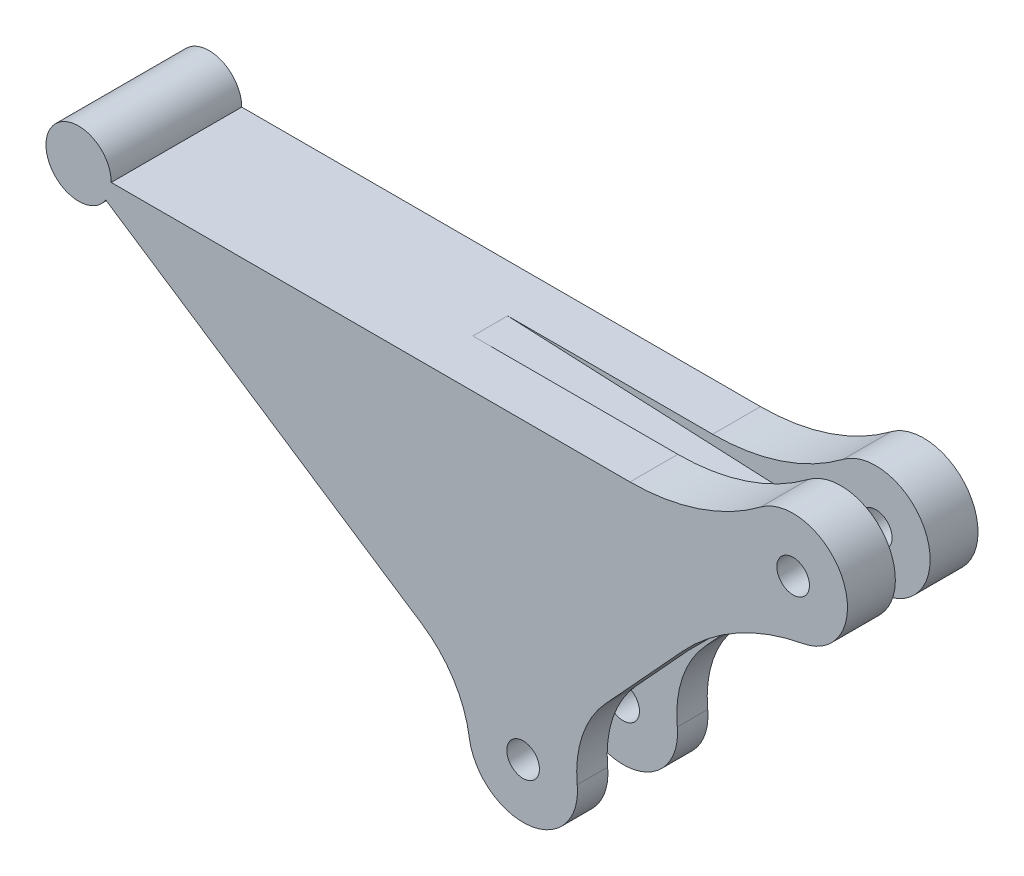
from build123d import *

# Parameters (mm, degrees)
ESQUISSE1_R                  = 1.5
BOSS_EXTRU_1_DEPTH           = 12
ENL_V_MAT_EXTRU_1_DEPTH      = 1.6
ENL_V_MAT_EXTRU_1_DEPTH_BACK = 1.6
ESQUISSE2_R                  = 1.5
ENL_V_MAT_EXTRU_2_DEPTH      = 3.2
ENL_V_MAT_EXTRU_2_DEPTH_BACK = 3.2
CONG_1_R                     = 20
CONG_2_R                     = 10


with BuildPart() as part:
    # Esquisse1 → Boss.-Extru.1 (new body)
    with BuildSketch(Plane.XY):
        with BuildLine():
            ThreePointArc((-62.7, 0), (-68.572901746, 0.863965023), (-63.197623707, -1.654724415))
            Line((-63.197623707, -1.654724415), (-28.998481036, -24.269291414))
            ThreePointArc((-28.998481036, -24.269291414), (-24.220521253, -31.990143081), (-21.445312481, -23.344990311))
            Line((-21.445312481, -23.344990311), (-3.382541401, -3.682175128))
            ThreePointArc((-3.382541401, -3.682175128), (4.577810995, 2.01088202), (-5, 0))
            Line((-5, 0), (-62.7, 0))
        make_face()
        with Locations((-24.827853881, -27.027165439)):
            Circle(ESQUISSE1_R, mode=Mode.SUBTRACT)
        Circle(ESQUISSE1_R, mode=Mode.SUBTRACT)
    extrude(amount=BOSS_EXTRU_1_DEPTH)

    # Esquisse2 → Enl_v. mat.-Extru.1 (cut, two sides: drawn at the far end of the back side and taken through both)
    with BuildSketch(Plane(origin=(0, 0, 6), x_dir=(-1, 0, 0), z_dir=(0, 0, -1)).offset(-ENL_V_MAT_EXTRU_1_DEPTH_BACK)):
        with BuildLine():
            Line((4.81333822, -1.353430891), (33.85, 0))
            Line((33.85, 0), (5, 0))
            ThreePointArc((5, 0), (-4.577810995, 2.01088202), (3.382541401, -3.682175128))
            Line((3.382541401, -3.682175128), (12.413926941, -13.513582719))
            Line((12.413926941, -13.513582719), (4.81333822, -1.353430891))
        make_face()
        Circle(ESQUISSE2_R, mode=Mode.SUBTRACT)
    extrude(amount=ENL_V_MAT_EXTRU_1_DEPTH + ENL_V_MAT_EXTRU_1_DEPTH_BACK, mode=Mode.SUBTRACT)

    # Esquisse3 → Enl_v. mat.-Extru.2 (cut, two sides: drawn at the far end of the back side and taken through both)
    with BuildSketch(Plane(origin=(0, 0, 6), x_dir=(-1, 0, 0), z_dir=(0, 0, -1)).offset(-ENL_V_MAT_EXTRU_2_DEPTH_BACK)):
        with BuildLine():
            Line((27.360983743, -19.438802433), (46.098052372, -12.962007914))
            Line((46.098052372, -12.962007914), (28.998481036, -24.269291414))
            ThreePointArc((28.998481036, -24.269291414), (24.220521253, -31.990143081), (21.445312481, -23.344990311))
            Line((21.445312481, -23.344990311), (12.413926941, -13.513582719))
            Line((12.413926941, -13.513582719), (27.360983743, -19.438802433))
        make_face()
    extrude(amount=ENL_V_MAT_EXTRU_2_DEPTH + ENL_V_MAT_EXTRU_2_DEPTH_BACK, mode=Mode.SUBTRACT)

    # Cong_1
    cong_1_edges = [part.edges().sort_by_distance(p)[0] for p in [
        (-3.382541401, -3.682175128, 9.8),
        (-5, 0, 9.8),
        (-3.382541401, -3.682175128, 2.2),
        (-5, 0, 2.2),
    ]]
    fillet(cong_1_edges, radius=CONG_1_R)

    # Cong_2
    cong_2_edges = [part.edges().sort_by_distance(p)[0] for p in [
        (-21.445312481, -23.344990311, 10.6),
        (-28.998481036, -24.269291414, 10.6),
        (-21.445312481, -23.344990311, 1.4),
        (-28.998481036, -24.269291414, 1.4),
    ]]
    fillet(cong_2_edges, radius=CONG_2_R)


solid = part.part
